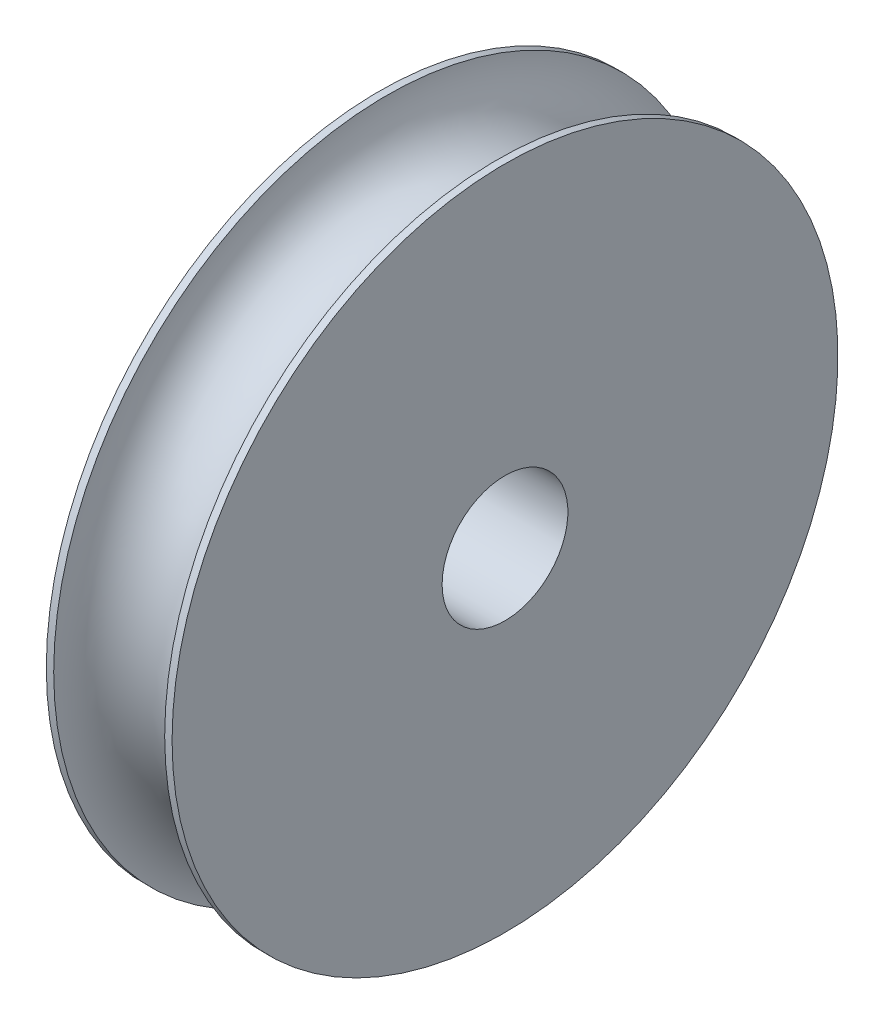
ISO-10303-21;
HEADER;
FILE_DESCRIPTION(('STEP AP214'),'2;1');
FILE_NAME('part.step','',(''),(''),'','','');
FILE_SCHEMA(('AUTOMOTIVE_DESIGN { 1 0 10303 214 1 1 1 1 }'));
ENDSEC;
DATA;
#1=APPLICATION_CONTEXT('core data for automotive mechanical design processes');
#2=APPLICATION_PROTOCOL_DEFINITION('international standard','automotive_design',2000,#1);
#3=PRODUCT_CONTEXT('',#1,'mechanical');
#4=PRODUCT('Part','Part','',(#3));
#5=PRODUCT_RELATED_PRODUCT_CATEGORY('part','',(#4));
#6=PRODUCT_DEFINITION_FORMATION('','',#4);
#7=PRODUCT_DEFINITION_CONTEXT('part definition',#1,'design');
#8=PRODUCT_DEFINITION('design','',#6,#7);
#9=PRODUCT_DEFINITION_SHAPE('','',#8);
#10=(LENGTH_UNIT() NAMED_UNIT(*) SI_UNIT(.MILLI.,.METRE.));
#11=(NAMED_UNIT(*) PLANE_ANGLE_UNIT() SI_UNIT($,.RADIAN.));
#12=(NAMED_UNIT(*) SI_UNIT($,.STERADIAN.) SOLID_ANGLE_UNIT());
#13=UNCERTAINTY_MEASURE_WITH_UNIT(LENGTH_MEASURE(1.E-05),#10,'distance_accuracy_value','');
#14=(GEOMETRIC_REPRESENTATION_CONTEXT(3) GLOBAL_UNCERTAINTY_ASSIGNED_CONTEXT((#13)) GLOBAL_UNIT_ASSIGNED_CONTEXT((#10,
#11,#12)) REPRESENTATION_CONTEXT('',''));
#15=CARTESIAN_POINT('',(0.,0.,0.));
#16=DIRECTION('',(0.,0.,1.));
#17=DIRECTION('',(1.,0.,0.));
#18=AXIS2_PLACEMENT_3D('',#15,#16,#17);
#19=CARTESIAN_POINT('',(0.,0.,0.));
#20=DIRECTION('',(-1.,0.,0.));
#21=DIRECTION('',(0.,0.,1.));
#22=AXIS2_PLACEMENT_3D('',#19,#20,#21);
#23=CYLINDRICAL_SURFACE('',#22,90.);
#24=CARTESIAN_POINT('',(0.,0.,0.));
#25=DIRECTION('',(-1.,0.,0.));
#26=DIRECTION('',(0.,0.,1.));
#27=AXIS2_PLACEMENT_3D('',#24,#25,#26);
#28=CIRCLE('',#27,90.);
#29=CARTESIAN_POINT('',(0.,0.,90.));
#30=VERTEX_POINT('',#29);
#31=EDGE_CURVE('E10',#30,#30,#28,.T.);
#32=ORIENTED_EDGE('',*,*,#31,.F.);
#33=EDGE_LOOP('',(#32));
#34=FACE_BOUND('',#33,.T.);
#35=CARTESIAN_POINT('',(2.,0.,0.));
#36=DIRECTION('',(-1.,0.,0.));
#37=DIRECTION('',(0.,0.,1.));
#38=AXIS2_PLACEMENT_3D('',#35,#36,#37);
#39=CIRCLE('',#38,90.);
#40=CARTESIAN_POINT('',(2.,0.,90.));
#41=VERTEX_POINT('',#40);
#42=EDGE_CURVE('E53',#41,#41,#39,.T.);
#43=ORIENTED_EDGE('',*,*,#42,.T.);
#44=EDGE_LOOP('',(#43));
#45=FACE_BOUND('',#44,.T.);
#46=ADVANCED_FACE('F31',(#34,#45),#23,.T.);
#47=CARTESIAN_POINT('',(0.,17.,0.));
#48=DIRECTION('',(1.,0.,0.));
#49=DIRECTION('',(0.,0.,-1.));
#50=AXIS2_PLACEMENT_3D('',#47,#48,#49);
#51=PLANE('',#50);
#52=CARTESIAN_POINT('',(0.,0.,0.));
#53=DIRECTION('',(-1.,0.,0.));
#54=DIRECTION('',(0.,0.,1.));
#55=AXIS2_PLACEMENT_3D('',#52,#53,#54);
#56=CIRCLE('',#55,17.);
#57=CARTESIAN_POINT('',(0.,0.,17.));
#58=VERTEX_POINT('',#57);
#59=EDGE_CURVE('E37',#58,#58,#56,.T.);
#60=ORIENTED_EDGE('',*,*,#59,.F.);
#61=EDGE_LOOP('',(#60));
#62=FACE_BOUND('',#61,.T.);
#63=ORIENTED_EDGE('',*,*,#31,.T.);
#64=EDGE_LOOP('',(#63));
#65=FACE_BOUND('',#64,.T.);
#66=ADVANCED_FACE('F78',(#62,#65),#51,.F.);
#67=CARTESIAN_POINT('',(0.,0.,0.));
#68=DIRECTION('',(-1.,0.,0.));
#69=DIRECTION('',(0.,0.,1.));
#70=AXIS2_PLACEMENT_3D('',#67,#68,#69);
#71=CYLINDRICAL_SURFACE('',#70,17.);
#72=CARTESIAN_POINT('',(34.,0.,0.));
#73=DIRECTION('',(-1.,0.,0.));
#74=DIRECTION('',(0.,0.,1.));
#75=AXIS2_PLACEMENT_3D('',#72,#73,#74);
#76=CIRCLE('',#75,17.);
#77=CARTESIAN_POINT('',(34.,0.,17.));
#78=VERTEX_POINT('',#77);
#79=EDGE_CURVE('E41',#78,#78,#76,.T.);
#80=ORIENTED_EDGE('',*,*,#79,.F.);
#81=EDGE_LOOP('',(#80));
#82=FACE_BOUND('',#81,.T.);
#83=ORIENTED_EDGE('',*,*,#59,.T.);
#84=EDGE_LOOP('',(#83));
#85=FACE_BOUND('',#84,.T.);
#86=ADVANCED_FACE('F73',(#82,#85),#71,.F.);
#87=CARTESIAN_POINT('',(34.,90.,0.));
#88=DIRECTION('',(-1.,0.,0.));
#89=DIRECTION('',(0.,0.,1.));
#90=AXIS2_PLACEMENT_3D('',#87,#88,#89);
#91=PLANE('',#90);
#92=CARTESIAN_POINT('',(34.,0.,0.));
#93=DIRECTION('',(-1.,0.,0.));
#94=DIRECTION('',(0.,0.,1.));
#95=AXIS2_PLACEMENT_3D('',#92,#93,#94);
#96=CIRCLE('',#95,90.);
#97=CARTESIAN_POINT('',(34.,0.,90.));
#98=VERTEX_POINT('',#97);
#99=EDGE_CURVE('E45',#98,#98,#96,.T.);
#100=ORIENTED_EDGE('',*,*,#99,.F.);
#101=EDGE_LOOP('',(#100));
#102=FACE_BOUND('',#101,.T.);
#103=ORIENTED_EDGE('',*,*,#79,.T.);
#104=EDGE_LOOP('',(#103));
#105=FACE_BOUND('',#104,.T.);
#106=ADVANCED_FACE('F67',(#102,#105),#91,.F.);
#107=CARTESIAN_POINT('',(0.,0.,0.));
#108=DIRECTION('',(-1.,0.,0.));
#109=DIRECTION('',(0.,0.,1.));
#110=AXIS2_PLACEMENT_3D('',#107,#108,#109);
#111=CYLINDRICAL_SURFACE('',#110,90.);
#112=CARTESIAN_POINT('',(32.,0.,0.));
#113=DIRECTION('',(-1.,0.,0.));
#114=DIRECTION('',(0.,0.,1.));
#115=AXIS2_PLACEMENT_3D('',#112,#113,#114);
#116=CIRCLE('',#115,90.);
#117=CARTESIAN_POINT('',(32.,0.,90.));
#118=VERTEX_POINT('',#117);
#119=EDGE_CURVE('E50',#118,#118,#116,.T.);
#120=ORIENTED_EDGE('',*,*,#119,.F.);
#121=EDGE_LOOP('',(#120));
#122=FACE_BOUND('',#121,.T.);
#123=ORIENTED_EDGE('',*,*,#99,.T.);
#124=EDGE_LOOP('',(#123));
#125=FACE_BOUND('',#124,.T.);
#126=ADVANCED_FACE('F61',(#122,#125),#111,.T.);
#127=CARTESIAN_POINT('',(17.,0.,0.));
#128=DIRECTION('',(-1.,0.,0.));
#129=DIRECTION('',(0.,0.,1.));
#130=AXIS2_PLACEMENT_3D('',#127,#128,#129);
#131=TOROIDAL_SURFACE('',#130,90.,15.);
#132=ORIENTED_EDGE('',*,*,#42,.F.);
#133=EDGE_LOOP('',(#132));
#134=FACE_BOUND('',#133,.T.);
#135=ORIENTED_EDGE('',*,*,#119,.T.);
#136=EDGE_LOOP('',(#135));
#137=FACE_BOUND('',#136,.T.);
#138=ADVANCED_FACE('F58',(#134,#137),#131,.F.);
#139=CLOSED_SHELL('',(#46,#66,#86,#106,#126,#138));
#140=MANIFOLD_SOLID_BREP('B2',#139);
#141=ADVANCED_BREP_SHAPE_REPRESENTATION('',(#18,#140),#14);
#142=SHAPE_DEFINITION_REPRESENTATION(#9,#141);
ENDSEC;
END-ISO-10303-21;
